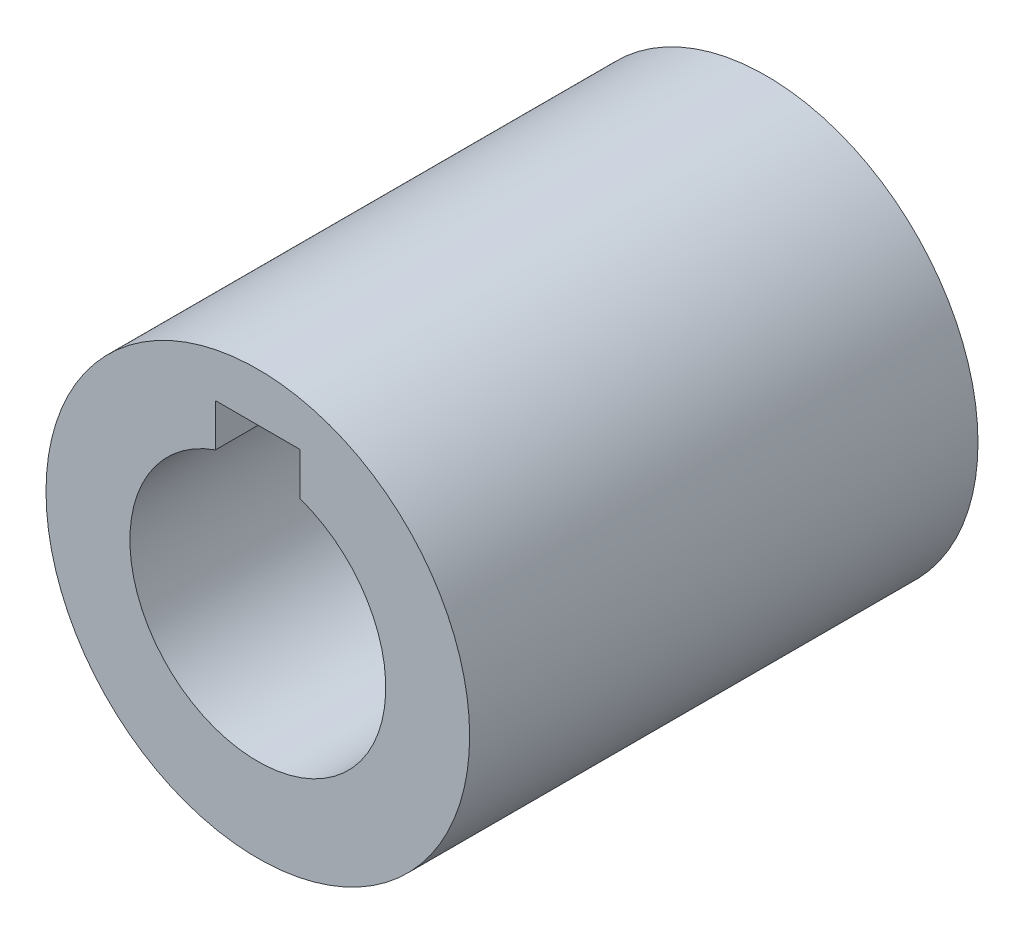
ISO-10303-21;
HEADER;
FILE_DESCRIPTION(('STEP AP214'),'2;1');
FILE_NAME('part.step','',(''),(''),'','','');
FILE_SCHEMA(('AUTOMOTIVE_DESIGN { 1 0 10303 214 1 1 1 1 }'));
ENDSEC;
DATA;
#1=APPLICATION_CONTEXT('core data for automotive mechanical design processes');
#2=APPLICATION_PROTOCOL_DEFINITION('international standard','automotive_design',2000,#1);
#3=PRODUCT_CONTEXT('',#1,'mechanical');
#4=PRODUCT('Part','Part','',(#3));
#5=PRODUCT_RELATED_PRODUCT_CATEGORY('part','',(#4));
#6=PRODUCT_DEFINITION_FORMATION('','',#4);
#7=PRODUCT_DEFINITION_CONTEXT('part definition',#1,'design');
#8=PRODUCT_DEFINITION('design','',#6,#7);
#9=PRODUCT_DEFINITION_SHAPE('','',#8);
#10=(LENGTH_UNIT() NAMED_UNIT(*) SI_UNIT(.MILLI.,.METRE.));
#11=(NAMED_UNIT(*) PLANE_ANGLE_UNIT() SI_UNIT($,.RADIAN.));
#12=(NAMED_UNIT(*) SI_UNIT($,.STERADIAN.) SOLID_ANGLE_UNIT());
#13=UNCERTAINTY_MEASURE_WITH_UNIT(LENGTH_MEASURE(1.E-05),#10,'distance_accuracy_value','');
#14=(GEOMETRIC_REPRESENTATION_CONTEXT(3) GLOBAL_UNCERTAINTY_ASSIGNED_CONTEXT((#13)) GLOBAL_UNIT_ASSIGNED_CONTEXT((#10,
#11,#12)) REPRESENTATION_CONTEXT('',''));
#15=CARTESIAN_POINT('',(0.,0.,0.));
#16=DIRECTION('',(0.,0.,1.));
#17=DIRECTION('',(1.,0.,0.));
#18=AXIS2_PLACEMENT_3D('',#15,#16,#17);
#19=CARTESIAN_POINT('',(0.,0.,19.05));
#20=DIRECTION('',(0.,0.,1.));
#21=DIRECTION('',(1.,0.,0.));
#22=AXIS2_PLACEMENT_3D('',#19,#20,#21);
#23=PLANE('',#22);
#24=DIRECTION('',(0.,-1.,0.));
#25=VECTOR('',#24,1.);
#26=CARTESIAN_POINT('',(-3.175,9.04758018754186,19.05));
#27=LINE('',#26,#25);
#28=CARTESIAN_POINT('',(-3.175,12.2479801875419,19.05));
#29=VERTEX_POINT('',#28);
#30=CARTESIAN_POINT('',(-3.175,9.04758018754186,19.05));
#31=VERTEX_POINT('',#30);
#32=EDGE_CURVE('E75',#29,#31,#27,.T.);
#33=ORIENTED_EDGE('',*,*,#32,.F.);
#34=DIRECTION('',(-1.,0.,0.));
#35=VECTOR('',#34,1.);
#36=CARTESIAN_POINT('',(-3.175,12.2479801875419,19.05));
#37=LINE('',#36,#35);
#38=CARTESIAN_POINT('',(3.175,12.2479801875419,19.05));
#39=VERTEX_POINT('',#38);
#40=EDGE_CURVE('E111',#39,#29,#37,.T.);
#41=ORIENTED_EDGE('',*,*,#40,.F.);
#42=DIRECTION('',(0.,1.,0.));
#43=VECTOR('',#42,1.);
#44=CARTESIAN_POINT('',(3.175,9.04758018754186,19.05));
#45=LINE('',#44,#43);
#46=CARTESIAN_POINT('',(3.175,9.04758018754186,19.05));
#47=VERTEX_POINT('',#46);
#48=EDGE_CURVE('E83',#47,#39,#45,.T.);
#49=ORIENTED_EDGE('',*,*,#48,.F.);
#50=CARTESIAN_POINT('',(0.,0.,19.05));
#51=DIRECTION('',(0.,0.,1.));
#52=DIRECTION('',(1.,0.,0.));
#53=AXIS2_PLACEMENT_3D('',#50,#51,#52);
#54=CIRCLE('',#53,9.5885);
#55=EDGE_CURVE('E89',#31,#47,#54,.T.);
#56=ORIENTED_EDGE('',*,*,#55,.F.);
#57=EDGE_LOOP('',(#33,#41,#49,#56));
#58=FACE_BOUND('',#57,.T.);
#59=CARTESIAN_POINT('',(0.,0.,19.05));
#60=DIRECTION('',(0.,0.,1.));
#61=DIRECTION('',(1.,0.,0.));
#62=AXIS2_PLACEMENT_3D('',#59,#60,#61);
#63=CIRCLE('',#62,15.875);
#64=CARTESIAN_POINT('',(-15.875,0.,19.05));
#65=VERTEX_POINT('',#64);
#66=EDGE_CURVE('E11',#65,#65,#63,.T.);
#67=ORIENTED_EDGE('',*,*,#66,.T.);
#68=EDGE_LOOP('',(#67));
#69=FACE_BOUND('',#68,.T.);
#70=ADVANCED_FACE('F34',(#58,#69),#23,.T.);
#71=CARTESIAN_POINT('',(0.,0.,-19.05));
#72=DIRECTION('',(0.,0.,1.));
#73=DIRECTION('',(1.,0.,0.));
#74=AXIS2_PLACEMENT_3D('',#71,#72,#73);
#75=PLANE('',#74);
#76=CARTESIAN_POINT('',(0.,0.,-19.05));
#77=DIRECTION('',(0.,0.,1.));
#78=DIRECTION('',(1.,0.,0.));
#79=AXIS2_PLACEMENT_3D('',#76,#77,#78);
#80=CIRCLE('',#79,15.875);
#81=CARTESIAN_POINT('',(-15.875,0.,-19.05));
#82=VERTEX_POINT('',#81);
#83=EDGE_CURVE('E42',#82,#82,#80,.T.);
#84=ORIENTED_EDGE('',*,*,#83,.F.);
#85=EDGE_LOOP('',(#84));
#86=FACE_BOUND('',#85,.T.);
#87=DIRECTION('',(-1.,0.,0.));
#88=VECTOR('',#87,1.);
#89=CARTESIAN_POINT('',(-3.175,12.2479801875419,-19.05));
#90=LINE('',#89,#88);
#91=CARTESIAN_POINT('',(3.175,12.2479801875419,-19.05));
#92=VERTEX_POINT('',#91);
#93=CARTESIAN_POINT('',(-3.175,12.2479801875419,-19.05));
#94=VERTEX_POINT('',#93);
#95=EDGE_CURVE('E93',#92,#94,#90,.T.);
#96=ORIENTED_EDGE('',*,*,#95,.T.);
#97=DIRECTION('',(0.,-1.,0.));
#98=VECTOR('',#97,1.);
#99=CARTESIAN_POINT('',(-3.175,9.04758018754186,-19.05));
#100=LINE('',#99,#98);
#101=CARTESIAN_POINT('',(-3.175,9.04758018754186,-19.05));
#102=VERTEX_POINT('',#101);
#103=EDGE_CURVE('E109',#94,#102,#100,.T.);
#104=ORIENTED_EDGE('',*,*,#103,.T.);
#105=CARTESIAN_POINT('',(0.,0.,-19.05));
#106=DIRECTION('',(0.,0.,1.));
#107=DIRECTION('',(1.,0.,0.));
#108=AXIS2_PLACEMENT_3D('',#105,#106,#107);
#109=CIRCLE('',#108,9.5885);
#110=CARTESIAN_POINT('',(3.175,9.04758018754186,-19.05));
#111=VERTEX_POINT('',#110);
#112=EDGE_CURVE('E91',#102,#111,#109,.T.);
#113=ORIENTED_EDGE('',*,*,#112,.T.);
#114=DIRECTION('',(0.,1.,0.));
#115=VECTOR('',#114,1.);
#116=CARTESIAN_POINT('',(3.175,9.04758018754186,-19.05));
#117=LINE('',#116,#115);
#118=EDGE_CURVE('E49',#111,#92,#117,.T.);
#119=ORIENTED_EDGE('',*,*,#118,.T.);
#120=EDGE_LOOP('',(#96,#104,#113,#119));
#121=FACE_BOUND('',#120,.T.);
#122=ADVANCED_FACE('F116',(#86,#121),#75,.F.);
#123=CARTESIAN_POINT('',(0.,0.,19.05));
#124=DIRECTION('',(0.,0.,-1.));
#125=DIRECTION('',(-1.,0.,0.));
#126=AXIS2_PLACEMENT_3D('',#123,#124,#125);
#127=CYLINDRICAL_SURFACE('',#126,15.875);
#128=CARTESIAN_POINT('',(-15.875,0.,19.05));
#129=CARTESIAN_POINT('',(-15.875,0.,18.653125));
#130=CARTESIAN_POINT('',(-15.875,0.,18.25625));
#131=CARTESIAN_POINT('',(-15.875,0.,17.4625));
#132=CARTESIAN_POINT('',(-15.875,0.,17.065625));
#133=CARTESIAN_POINT('',(-15.875,0.,16.271875));
#134=CARTESIAN_POINT('',(-15.875,0.,15.875));
#135=CARTESIAN_POINT('',(-15.875,0.,15.08125));
#136=CARTESIAN_POINT('',(-15.875,0.,14.684375));
#137=CARTESIAN_POINT('',(-15.875,0.,13.890625));
#138=CARTESIAN_POINT('',(-15.875,0.,13.49375));
#139=CARTESIAN_POINT('',(-15.875,0.,12.7));
#140=CARTESIAN_POINT('',(-15.875,0.,12.303125));
#141=CARTESIAN_POINT('',(-15.875,0.,11.509375));
#142=CARTESIAN_POINT('',(-15.875,0.,11.1125));
#143=CARTESIAN_POINT('',(-15.875,0.,10.31875));
#144=CARTESIAN_POINT('',(-15.875,0.,9.921875));
#145=CARTESIAN_POINT('',(-15.875,0.,9.128125));
#146=CARTESIAN_POINT('',(-15.875,0.,8.73125));
#147=CARTESIAN_POINT('',(-15.875,0.,7.9375));
#148=CARTESIAN_POINT('',(-15.875,0.,7.540625));
#149=CARTESIAN_POINT('',(-15.875,0.,6.746875));
#150=CARTESIAN_POINT('',(-15.875,0.,6.35));
#151=CARTESIAN_POINT('',(-15.875,0.,5.55625));
#152=CARTESIAN_POINT('',(-15.875,0.,5.159375));
#153=CARTESIAN_POINT('',(-15.875,0.,4.365625));
#154=CARTESIAN_POINT('',(-15.875,0.,3.96875));
#155=CARTESIAN_POINT('',(-15.875,0.,3.175));
#156=CARTESIAN_POINT('',(-15.875,0.,2.778125));
#157=CARTESIAN_POINT('',(-15.875,0.,1.984375));
#158=CARTESIAN_POINT('',(-15.875,0.,1.5875));
#159=CARTESIAN_POINT('',(-15.875,0.,0.793749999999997));
#160=CARTESIAN_POINT('',(-15.875,0.,0.396874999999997));
#161=CARTESIAN_POINT('',(-15.875,0.,-0.396875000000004));
#162=CARTESIAN_POINT('',(-15.875,0.,-0.793750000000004));
#163=CARTESIAN_POINT('',(-15.875,0.,-1.5875));
#164=CARTESIAN_POINT('',(-15.875,0.,-1.984375));
#165=CARTESIAN_POINT('',(-15.875,0.,-2.77812500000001));
#166=CARTESIAN_POINT('',(-15.875,0.,-3.17500000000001));
#167=CARTESIAN_POINT('',(-15.875,0.,-3.96875000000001));
#168=CARTESIAN_POINT('',(-15.875,0.,-4.36562500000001));
#169=CARTESIAN_POINT('',(-15.875,0.,-5.15937500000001));
#170=CARTESIAN_POINT('',(-15.875,0.,-5.55625));
#171=CARTESIAN_POINT('',(-15.875,0.,-6.35));
#172=CARTESIAN_POINT('',(-15.875,0.,-6.746875));
#173=CARTESIAN_POINT('',(-15.875,0.,-7.540625));
#174=CARTESIAN_POINT('',(-15.875,0.,-7.93750000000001));
#175=CARTESIAN_POINT('',(-15.875,0.,-8.73125));
#176=CARTESIAN_POINT('',(-15.875,0.,-9.12812500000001));
#177=CARTESIAN_POINT('',(-15.875,0.,-9.92187500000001));
#178=CARTESIAN_POINT('',(-15.875,0.,-10.31875));
#179=CARTESIAN_POINT('',(-15.875,0.,-11.1125));
#180=CARTESIAN_POINT('',(-15.875,0.,-11.509375));
#181=CARTESIAN_POINT('',(-15.875,0.,-12.303125));
#182=CARTESIAN_POINT('',(-15.875,0.,-12.7));
#183=CARTESIAN_POINT('',(-15.875,0.,-13.49375));
#184=CARTESIAN_POINT('',(-15.875,0.,-13.890625));
#185=CARTESIAN_POINT('',(-15.875,0.,-14.684375));
#186=CARTESIAN_POINT('',(-15.875,0.,-15.08125));
#187=CARTESIAN_POINT('',(-15.875,0.,-15.875));
#188=CARTESIAN_POINT('',(-15.875,0.,-16.271875));
#189=CARTESIAN_POINT('',(-15.875,0.,-17.065625));
#190=CARTESIAN_POINT('',(-15.875,0.,-17.4625));
#191=CARTESIAN_POINT('',(-15.875,0.,-18.25625));
#192=CARTESIAN_POINT('',(-15.875,0.,-18.653125));
#193=CARTESIAN_POINT('',(-15.875,0.,-19.05));
#194=B_SPLINE_CURVE_WITH_KNOTS('',3,(#128,#129,#130,#131,#132,#133,#134,#135,#136,#137,#138,
#139,#140,#141,#142,#143,#144,#145,#146,#147,#148,#149,#150,#151,#152,#153,#154,#155,#156,#157,
#158,#159,#160,#161,#162,#163,#164,#165,#166,#167,#168,#169,#170,#171,#172,#173,#174,#175,#176,
#177,#178,#179,#180,#181,#182,#183,#184,#185,#186,#187,#188,#189,#190,#191,#192,#193),
.UNSPECIFIED.,.F.,.F.,(4,2,2,2,2,2,2,2,2,2,2,2,2,2,2,2,2,2,2,2,2,2,2,2,2,2,2,2,2,2,2,2,4),(0.,
1.190625,2.38125,3.571875,4.7625,5.953125,7.14375,8.334375,9.525,10.715625,11.90625,13.096875,
14.2875,15.478125,16.66875,17.859375,19.05,20.240625,21.43125,22.621875,23.8125,25.003125,
26.19375,27.384375,28.575,29.765625,30.95625,32.146875,33.3375,34.528125,35.71875,36.909375,
38.1),.UNSPECIFIED.);
#195=EDGE_CURVE('BSEAM36',#65,#82,#194,.T.);
#196=ORIENTED_EDGE('',*,*,#66,.F.);
#197=ORIENTED_EDGE('',*,*,#83,.T.);
#198=ORIENTED_EDGE('',*,*,#195,.T.);
#199=ORIENTED_EDGE('',*,*,#195,.F.);
#200=EDGE_LOOP('',(#196,#198,#197,#199));
#201=FACE_BOUND('',#200,.T.);
#202=ADVANCED_FACE('F36',(#201),#127,.T.);
#203=CARTESIAN_POINT('',(0.,0.,19.05));
#204=DIRECTION('',(0.,0.,-1.));
#205=DIRECTION('',(-1.,0.,0.));
#206=AXIS2_PLACEMENT_3D('',#203,#204,#205);
#207=CYLINDRICAL_SURFACE('',#206,9.5885);
#208=DIRECTION('',(0.,0.,1.));
#209=VECTOR('',#208,1.);
#210=CARTESIAN_POINT('',(-3.175,9.04758018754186,-19.05));
#211=LINE('',#210,#209);
#212=EDGE_CURVE('E78',#102,#31,#211,.T.);
#213=ORIENTED_EDGE('',*,*,#212,.T.);
#214=ORIENTED_EDGE('',*,*,#55,.T.);
#215=DIRECTION('',(0.,0.,1.));
#216=VECTOR('',#215,1.);
#217=CARTESIAN_POINT('',(3.175,9.04758018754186,-19.05));
#218=LINE('',#217,#216);
#219=EDGE_CURVE('E92',#111,#47,#218,.T.);
#220=ORIENTED_EDGE('',*,*,#219,.F.);
#221=ORIENTED_EDGE('',*,*,#112,.F.);
#222=EDGE_LOOP('',(#213,#214,#220,#221));
#223=FACE_BOUND('',#222,.T.);
#224=ADVANCED_FACE('F88',(#223),#207,.F.);
#225=CARTESIAN_POINT('',(-3.175,9.04758018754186,-19.05));
#226=DIRECTION('',(-1.,0.,0.));
#227=DIRECTION('',(0.,0.,1.));
#228=AXIS2_PLACEMENT_3D('',#225,#226,#227);
#229=PLANE('',#228);
#230=ORIENTED_EDGE('',*,*,#32,.T.);
#231=ORIENTED_EDGE('',*,*,#212,.F.);
#232=ORIENTED_EDGE('',*,*,#103,.F.);
#233=DIRECTION('',(0.,0.,1.));
#234=VECTOR('',#233,1.);
#235=CARTESIAN_POINT('',(-3.175,12.2479801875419,-19.05));
#236=LINE('',#235,#234);
#237=EDGE_CURVE('E57',#94,#29,#236,.T.);
#238=ORIENTED_EDGE('',*,*,#237,.T.);
#239=EDGE_LOOP('',(#230,#231,#232,#238));
#240=FACE_BOUND('',#239,.T.);
#241=ADVANCED_FACE('F77',(#240),#229,.F.);
#242=CARTESIAN_POINT('',(-3.175,12.2479801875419,-19.05));
#243=DIRECTION('',(0.,1.,0.));
#244=DIRECTION('',(0.,0.,1.));
#245=AXIS2_PLACEMENT_3D('',#242,#243,#244);
#246=PLANE('',#245);
#247=ORIENTED_EDGE('',*,*,#40,.T.);
#248=ORIENTED_EDGE('',*,*,#237,.F.);
#249=ORIENTED_EDGE('',*,*,#95,.F.);
#250=DIRECTION('',(0.,0.,1.));
#251=VECTOR('',#250,1.);
#252=CARTESIAN_POINT('',(3.175,12.2479801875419,-19.05));
#253=LINE('',#252,#251);
#254=EDGE_CURVE('E103',#92,#39,#253,.T.);
#255=ORIENTED_EDGE('',*,*,#254,.T.);
#256=EDGE_LOOP('',(#247,#248,#249,#255));
#257=FACE_BOUND('',#256,.T.);
#258=ADVANCED_FACE('F114',(#257),#246,.F.);
#259=CARTESIAN_POINT('',(3.175,9.04758018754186,-19.05));
#260=DIRECTION('',(1.,0.,0.));
#261=DIRECTION('',(0.,0.,-1.));
#262=AXIS2_PLACEMENT_3D('',#259,#260,#261);
#263=PLANE('',#262);
#264=ORIENTED_EDGE('',*,*,#48,.T.);
#265=ORIENTED_EDGE('',*,*,#254,.F.);
#266=ORIENTED_EDGE('',*,*,#118,.F.);
#267=ORIENTED_EDGE('',*,*,#219,.T.);
#268=EDGE_LOOP('',(#264,#265,#266,#267));
#269=FACE_BOUND('',#268,.T.);
#270=ADVANCED_FACE('F113',(#269),#263,.F.);
#271=CLOSED_SHELL('',(#70,#122,#202,#224,#241,#258,#270));
#272=MANIFOLD_SOLID_BREP('B2',#271);
#273=ADVANCED_BREP_SHAPE_REPRESENTATION('',(#18,#272),#14);
#274=SHAPE_DEFINITION_REPRESENTATION(#9,#273);
ENDSEC;
END-ISO-10303-21;
